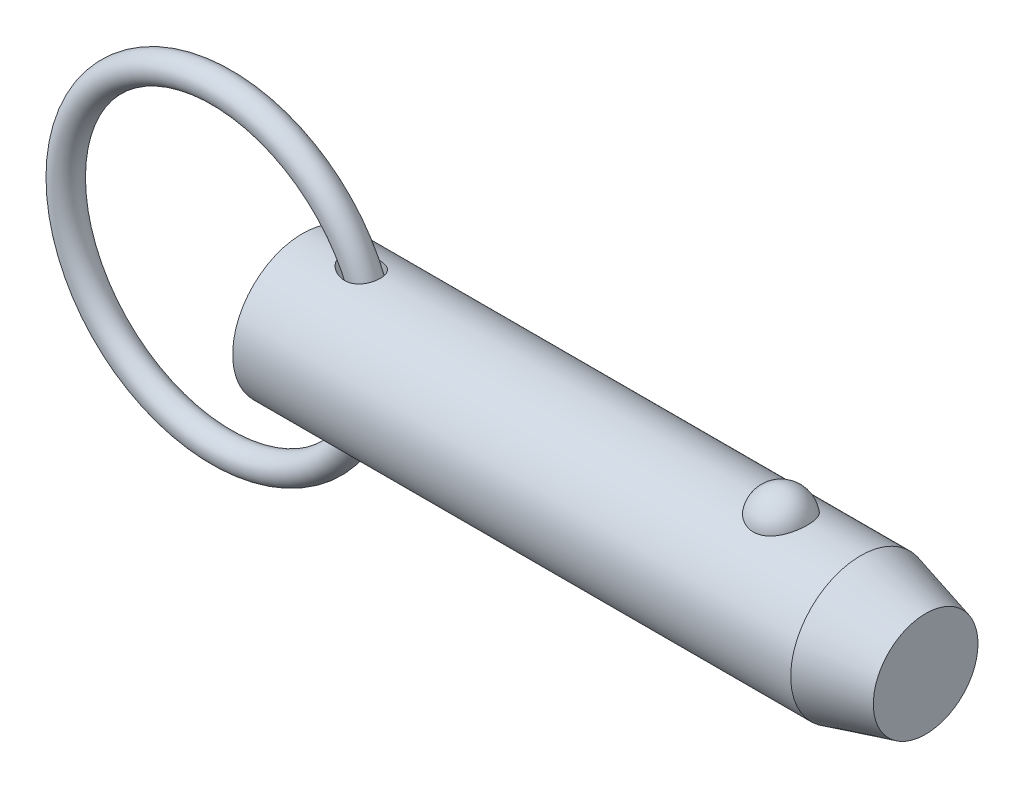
ISO-10303-21;
HEADER;
FILE_DESCRIPTION(('STEP AP214'),'2;1');
FILE_NAME('part.step','',(''),(''),'','','');
FILE_SCHEMA(('AUTOMOTIVE_DESIGN { 1 0 10303 214 1 1 1 1 }'));
ENDSEC;
DATA;
#1=APPLICATION_CONTEXT('core data for automotive mechanical design processes');
#2=APPLICATION_PROTOCOL_DEFINITION('international standard','automotive_design',2000,#1);
#3=PRODUCT_CONTEXT('',#1,'mechanical');
#4=PRODUCT('Part','Part','',(#3));
#5=PRODUCT_RELATED_PRODUCT_CATEGORY('part','',(#4));
#6=PRODUCT_DEFINITION_FORMATION('','',#4);
#7=PRODUCT_DEFINITION_CONTEXT('part definition',#1,'design');
#8=PRODUCT_DEFINITION('design','',#6,#7);
#9=PRODUCT_DEFINITION_SHAPE('','',#8);
#10=(LENGTH_UNIT() NAMED_UNIT(*) SI_UNIT(.MILLI.,.METRE.));
#11=(NAMED_UNIT(*) PLANE_ANGLE_UNIT() SI_UNIT($,.RADIAN.));
#12=(NAMED_UNIT(*) SI_UNIT($,.STERADIAN.) SOLID_ANGLE_UNIT());
#13=UNCERTAINTY_MEASURE_WITH_UNIT(LENGTH_MEASURE(1.E-05),#10,'distance_accuracy_value','');
#14=(GEOMETRIC_REPRESENTATION_CONTEXT(3) GLOBAL_UNCERTAINTY_ASSIGNED_CONTEXT((#13)) GLOBAL_UNIT_ASSIGNED_CONTEXT((#10,
#11,#12)) REPRESENTATION_CONTEXT('',''));
#15=CARTESIAN_POINT('',(0.,0.,0.));
#16=DIRECTION('',(0.,0.,1.));
#17=DIRECTION('',(1.,0.,0.));
#18=AXIS2_PLACEMENT_3D('',#15,#16,#17);
#19=CARTESIAN_POINT('',(-8.23730968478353,0.,0.));
#20=DIRECTION('',(0.,0.,1.));
#21=DIRECTION('',(1.,0.,0.));
#22=AXIS2_PLACEMENT_3D('',#19,#20,#21);
#23=TOROIDAL_SURFACE('',#22,15.875,1.422);
#24=CARTESIAN_POINT('',(9.05969031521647,0.,0.));
#25=VERTEX_POINT('',#24);
#26=VERTEX_LOOP('',#25);
#27=FACE_BOUND('',#26,.T.);
#28=ADVANCED_FACE('P0_F12',(#27),#23,.T.);
#29=CLOSED_SHELL('',(#28));
#30=MANIFOLD_SOLID_BREP('P0_B1',#29);
#31=CARTESIAN_POINT('',(0.,0.,0.));
#32=DIRECTION('',(1.,0.,0.));
#33=DIRECTION('',(0.,0.,-1.));
#34=AXIS2_PLACEMENT_3D('',#31,#32,#33);
#35=CYLINDRICAL_SURFACE('',#34,7.11);
#36=CARTESIAN_POINT('',(3.98467340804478,7.10072679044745,-0.363013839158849));
#37=CARTESIAN_POINT('',(4.00971652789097,7.09600153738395,-0.45539194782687));
#38=CARTESIAN_POINT('',(4.04401947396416,7.08958406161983,-0.545230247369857));
#39=CARTESIAN_POINT('',(4.12810160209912,7.07427055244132,-0.717157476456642));
#40=CARTESIAN_POINT('',(4.17791765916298,7.06536861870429,-0.799227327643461));
#41=CARTESIAN_POINT('',(4.28924471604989,7.04620300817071,-0.953469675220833));
#42=CARTESIAN_POINT('',(4.35063580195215,7.035953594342,-1.02573162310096));
#43=CARTESIAN_POINT('',(4.48282610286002,7.01493313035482,-1.16081412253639));
#44=CARTESIAN_POINT('',(4.55362244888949,7.00416223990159,-1.22363754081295));
#45=CARTESIAN_POINT('',(4.71659336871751,6.98090398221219,-1.35055080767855));
#46=CARTESIAN_POINT('',(4.81029272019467,6.96847103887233,-1.41269256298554));
#47=CARTESIAN_POINT('',(5.0057240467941,6.94515366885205,-1.52319699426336));
#48=CARTESIAN_POINT('',(5.10746392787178,6.93427079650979,-1.57154588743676));
#49=CARTESIAN_POINT('',(5.33503739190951,6.91346066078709,-1.66091325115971));
#50=CARTESIAN_POINT('',(5.46199550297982,6.90402388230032,-1.69921932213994));
#51=CARTESIAN_POINT('',(5.72084799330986,6.89024030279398,-1.75428261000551));
#52=CARTESIAN_POINT('',(5.85274301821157,6.88589416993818,-1.77103699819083));
#53=CARTESIAN_POINT('',(6.11557710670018,6.88337277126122,-1.78081990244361));
#54=CARTESIAN_POINT('',(6.24650031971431,6.88510489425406,-1.77420448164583));
#55=CARTESIAN_POINT('',(6.50446311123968,6.89478744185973,-1.73620392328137));
#56=CARTESIAN_POINT('',(6.6315075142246,6.90272978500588,-1.70485097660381));
#57=CARTESIAN_POINT('',(6.85933269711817,6.92243075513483,-1.62281888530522));
#58=CARTESIAN_POINT('',(6.96133251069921,6.93352131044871,-1.5753580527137));
#59=CARTESIAN_POINT('',(7.15436649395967,6.95824811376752,-1.46226310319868));
#60=CARTESIAN_POINT('',(7.24540699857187,6.97188287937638,-1.3966395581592));
#61=CARTESIAN_POINT('',(7.40446019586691,6.99838217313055,-1.25668991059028));
#62=CARTESIAN_POINT('',(7.473875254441,7.01118308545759,-1.18393777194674));
#63=CARTESIAN_POINT('',(7.59904891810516,7.03582803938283,-1.02736918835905));
#64=CARTESIAN_POINT('',(7.65481029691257,7.04767227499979,-0.943554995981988));
#65=CARTESIAN_POINT('',(7.74982438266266,7.06873077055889,-0.76979592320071));
#66=CARTESIAN_POINT('',(7.7894903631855,7.07800861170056,-0.680084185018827));
#67=CARTESIAN_POINT('',(7.85354088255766,7.09334756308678,-0.495102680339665));
#68=CARTESIAN_POINT('',(7.87792559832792,7.09940871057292,-0.399832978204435));
#69=CARTESIAN_POINT('',(7.9108898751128,7.10766731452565,-0.206294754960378));
#70=CARTESIAN_POINT('',(7.91944662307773,7.10985919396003,-0.108022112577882));
#71=CARTESIAN_POINT('',(7.920501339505,7.11012756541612,0.0886168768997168));
#72=CARTESIAN_POINT('',(7.91299895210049,7.10820396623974,0.186983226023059));
#73=CARTESIAN_POINT('',(7.88205794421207,7.10043733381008,0.381270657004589));
#74=CARTESIAN_POINT('',(7.85857985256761,7.09458459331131,0.477185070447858));
#75=CARTESIAN_POINT('',(7.79617406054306,7.07958431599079,0.663575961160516));
#76=CARTESIAN_POINT('',(7.75724672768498,7.07043685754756,0.754052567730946));
#77=CARTESIAN_POINT('',(7.66496731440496,7.04987259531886,0.926798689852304));
#78=CARTESIAN_POINT('',(7.61164530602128,7.0384605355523,1.00908483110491));
#79=CARTESIAN_POINT('',(7.49191707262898,7.01461776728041,1.16333092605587));
#80=CARTESIAN_POINT('',(7.42551210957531,7.00218715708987,1.235291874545));
#81=CARTESIAN_POINT('',(7.28164031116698,6.97770944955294,1.36680167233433));
#82=CARTESIAN_POINT('',(7.20420170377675,6.96566146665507,1.42638126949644));
#83=CARTESIAN_POINT('',(7.0403906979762,6.94319963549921,1.53199377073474));
#84=CARTESIAN_POINT('',(6.95401827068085,6.93278579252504,1.57802663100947));
#85=CARTESIAN_POINT('',(6.7731858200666,6.91444459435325,1.65656940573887));
#86=CARTESIAN_POINT('',(6.67860569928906,6.90656682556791,1.68881327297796));
#87=CARTESIAN_POINT('',(6.48544119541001,6.89422806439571,1.73849768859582));
#88=CARTESIAN_POINT('',(6.38685561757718,6.88976809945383,1.755933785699));
#89=CARTESIAN_POINT('',(6.18089829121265,6.88429907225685,1.77726234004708));
#90=CARTESIAN_POINT('',(6.07340937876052,6.88356485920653,1.78007646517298));
#91=CARTESIAN_POINT('',(5.85921220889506,6.886086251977,1.77029087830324));
#92=CARTESIAN_POINT('',(5.75250426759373,6.88934339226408,1.75768523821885));
#93=CARTESIAN_POINT('',(5.52848027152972,6.89994454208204,1.71563399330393));
#94=CARTESIAN_POINT('',(5.41155168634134,6.90775772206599,1.68424184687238));
#95=CARTESIAN_POINT('',(5.18376466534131,6.92670168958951,1.60454711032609));
#96=CARTESIAN_POINT('',(5.07291446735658,6.9378368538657,1.5562221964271));
#97=CARTESIAN_POINT('',(4.84835244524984,6.96347168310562,1.43744827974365));
#98=CARTESIAN_POINT('',(4.73562531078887,6.97820486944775,1.36517310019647));
#99=CARTESIAN_POINT('',(4.52504912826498,7.00822340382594,1.20158053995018));
#100=CARTESIAN_POINT('',(4.42717478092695,7.02350775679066,1.11029618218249));
#101=CARTESIAN_POINT('',(4.27935716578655,7.04784659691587,0.940654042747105));
#102=CARTESIAN_POINT('',(4.2239722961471,7.05736064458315,0.867099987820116));
#103=CARTESIAN_POINT('',(4.12558347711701,7.07469854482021,0.711919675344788));
#104=CARTESIAN_POINT('',(4.08256922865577,7.0825238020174,0.630300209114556));
#105=CARTESIAN_POINT('',(4.01142860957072,7.09565978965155,0.459428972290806));
#106=CARTESIAN_POINT('',(3.98346043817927,7.10094374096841,0.370107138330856));
#107=CARTESIAN_POINT('',(3.95517285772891,7.1063173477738,0.233358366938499));
#108=CARTESIAN_POINT('',(3.94802115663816,7.1076831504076,0.187321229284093));
#109=CARTESIAN_POINT('',(3.93842121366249,7.10951900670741,0.0947476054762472));
#110=CARTESIAN_POINT('',(3.93597129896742,7.10998937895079,0.0482113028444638));
#111=CARTESIAN_POINT('',(3.93584361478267,7.11001358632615,-0.0598597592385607));
#112=CARTESIAN_POINT('',(3.9399538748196,7.10922402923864,-0.121405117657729));
#113=CARTESIAN_POINT('',(3.95632793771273,7.10609781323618,-0.243320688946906));
#114=CARTESIAN_POINT('',(3.96859135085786,7.10376122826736,-0.303690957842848));
#115=CARTESIAN_POINT('',(3.98467340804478,7.10072679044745,-0.363013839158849));
#116=B_SPLINE_CURVE_WITH_KNOTS('',3,(#36,#37,#38,#39,#40,#41,#42,#43,#44,#45,#46,#47,#48,#49,
#50,#51,#52,#53,#54,#55,#56,#57,#58,#59,#60,#61,#62,#63,#64,#65,#66,#67,#68,#69,#70,#71,#72,#73,
#74,#75,#76,#77,#78,#79,#80,#81,#82,#83,#84,#85,#86,#87,#88,#89,#90,#91,#92,#93,#94,#95,#96,#97,
#98,#99,#100,#101,#102,#103,#104,#105,#106,#107,#108,#109,#110,#111,#112,#113,#114,#115),
.UNSPECIFIED.,.T.,.F.,(4,2,2,2,2,2,2,2,2,2,2,2,2,2,2,2,2,2,2,2,2,2,2,2,2,2,2,2,2,2,2,2,2,2,2,2,
2,2,2,4),(0.,0.287206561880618,0.575101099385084,0.860162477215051,1.14513709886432,
1.48324846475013,1.82169652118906,2.21865672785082,2.6156690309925,3.00665870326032,
3.39714041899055,3.73437585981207,4.07141541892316,4.37402271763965,4.67656849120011,
4.97076150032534,5.26495110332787,5.55956439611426,5.85418421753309,6.14953461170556,
6.44487798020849,6.73960905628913,7.03431171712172,7.32827352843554,7.6222362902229,
7.9216396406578,8.22113296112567,8.54242840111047,8.86384740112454,9.22635035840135,
9.58933304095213,9.99153142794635,10.3930368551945,10.6697219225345,10.9461759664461,
11.2254825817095,11.3650959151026,11.5046595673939,11.6891051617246,11.8735419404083),.UNSPECIFIED.);
#117=CARTESIAN_POINT('',(3.98467340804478,7.10072679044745,-0.363013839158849));
#118=VERTEX_POINT('',#117);
#119=EDGE_CURVE('P1_E40',#118,#118,#116,.T.);
#120=ORIENTED_EDGE('',*,*,#119,.T.);
#121=EDGE_LOOP('',(#120));
#122=FACE_BOUND('',#121,.T.);
#123=CARTESIAN_POINT('',(56.8362796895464,0.,0.));
#124=DIRECTION('',(1.,0.,0.));
#125=DIRECTION('',(0.,0.,-1.));
#126=AXIS2_PLACEMENT_3D('',#123,#124,#125);
#127=CIRCLE('',#126,7.11);
#128=CARTESIAN_POINT('',(56.8362796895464,0.,-7.11));
#129=VERTEX_POINT('',#128);
#130=EDGE_CURVE('P1_E25',#129,#129,#127,.T.);
#131=ORIENTED_EDGE('',*,*,#130,.F.);
#132=EDGE_LOOP('',(#131));
#133=FACE_BOUND('',#132,.T.);
#134=CARTESIAN_POINT('',(0.,0.,0.));
#135=DIRECTION('',(1.,0.,0.));
#136=DIRECTION('',(0.,0.,-1.));
#137=AXIS2_PLACEMENT_3D('',#134,#135,#136);
#138=CIRCLE('',#137,7.11);
#139=CARTESIAN_POINT('',(0.,0.,-7.11));
#140=VERTEX_POINT('',#139);
#141=EDGE_CURVE('P1_E9',#140,#140,#138,.T.);
#142=ORIENTED_EDGE('',*,*,#141,.T.);
#143=EDGE_LOOP('',(#142));
#144=FACE_BOUND('',#143,.T.);
#145=CARTESIAN_POINT('',(48.729258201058,6.53646663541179,2.79762469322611));
#146=CARTESIAN_POINT('',(48.5844296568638,6.53647876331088,2.79761243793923));
#147=CARTESIAN_POINT('',(48.439368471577,6.54144531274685,2.78608115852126));
#148=CARTESIAN_POINT('',(48.1532920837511,6.56077791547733,2.74023282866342));
#149=CARTESIAN_POINT('',(48.0122884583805,6.57516852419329,2.70585624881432));
#150=CARTESIAN_POINT('',(47.7388833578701,6.61165072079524,2.61544042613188));
#151=CARTESIAN_POINT('',(47.6064602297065,6.63372195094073,2.55945840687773));
#152=CARTESIAN_POINT('',(47.3532337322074,6.68316012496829,2.42742958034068));
#153=CARTESIAN_POINT('',(47.2324254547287,6.71052481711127,2.35139129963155));
#154=CARTESIAN_POINT('',(47.0016372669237,6.76860821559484,2.17866150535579));
#155=CARTESIAN_POINT('',(46.8920857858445,6.79940242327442,2.08142342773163));
#156=CARTESIAN_POINT('',(46.6903340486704,6.86050242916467,1.87020907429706));
#157=CARTESIAN_POINT('',(46.5981390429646,6.89080807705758,1.75622775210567));
#158=CARTESIAN_POINT('',(46.4292547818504,6.94923069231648,1.50900646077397));
#159=CARTESIAN_POINT('',(46.3534289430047,6.97719213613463,1.37513873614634));
#160=CARTESIAN_POINT('',(46.2242063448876,7.02647251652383,1.09584817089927));
#161=CARTESIAN_POINT('',(46.1708109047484,7.04779106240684,0.950424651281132));
#162=CARTESIAN_POINT('',(46.0871019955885,7.08180248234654,0.650508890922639));
#163=CARTESIAN_POINT('',(46.0570253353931,7.09440672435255,0.495940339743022));
#164=CARTESIAN_POINT('',(46.021473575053,7.10935121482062,0.183515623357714));
#165=CARTESIAN_POINT('',(46.0159974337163,7.11169189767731,0.0256595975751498));
#166=CARTESIAN_POINT('',(46.029700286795,7.10589702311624,-0.287512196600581));
#167=CARTESIAN_POINT('',(46.0486823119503,7.0978451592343,-0.442838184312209));
#168=CARTESIAN_POINT('',(46.1105745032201,7.07221860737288,-0.747830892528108));
#169=CARTESIAN_POINT('',(46.1534850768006,7.05464375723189,-0.897497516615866));
#170=CARTESIAN_POINT('',(46.2624527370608,7.01171031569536,-1.1872286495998));
#171=CARTESIAN_POINT('',(46.3285458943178,6.98633960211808,-1.32727778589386));
#172=CARTESIAN_POINT('',(46.4825362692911,6.93042258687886,-1.59370324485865));
#173=CARTESIAN_POINT('',(46.5704355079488,6.89987580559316,-1.72007829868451));
#174=CARTESIAN_POINT('',(46.7669269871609,6.83659510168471,-1.95657345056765));
#175=CARTESIAN_POINT('',(46.8756640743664,6.80384697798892,-2.06656957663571));
#176=CARTESIAN_POINT('',(47.1109686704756,6.7400183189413,-2.26611005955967));
#177=CARTESIAN_POINT('',(47.2375350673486,6.70893767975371,-2.35565569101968));
#178=CARTESIAN_POINT('',(47.5028454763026,6.65264442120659,-2.51019726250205));
#179=CARTESIAN_POINT('',(47.6413230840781,6.62733449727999,-2.5756139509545));
#180=CARTESIAN_POINT('',(47.9285194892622,6.58495995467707,-2.6821113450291));
#181=CARTESIAN_POINT('',(48.0772343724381,6.56789220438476,-2.72320129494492));
#182=CARTESIAN_POINT('',(48.3726268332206,6.54478663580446,-2.77825810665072));
#183=CARTESIAN_POINT('',(48.5190295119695,6.53823639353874,-2.7934872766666));
#184=CARTESIAN_POINT('',(48.8124700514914,6.53532718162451,-2.80028921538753));
#185=CARTESIAN_POINT('',(48.9595077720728,6.53896606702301,-2.79186696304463));
#186=CARTESIAN_POINT('',(49.2449210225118,6.55570357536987,-2.75232178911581));
#187=CARTESIAN_POINT('',(49.3834221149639,6.56848455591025,-2.7219607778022));
#188=CARTESIAN_POINT('',(49.6531142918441,6.60173528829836,-2.64028774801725));
#189=CARTESIAN_POINT('',(49.784304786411,6.62220565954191,-2.5889740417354));
#190=CARTESIAN_POINT('',(50.0388462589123,6.6691792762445,-2.46547820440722));
#191=CARTESIAN_POINT('',(50.1619691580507,6.69580233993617,-2.392872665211));
#192=CARTESIAN_POINT('',(50.3944418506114,6.75207041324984,-2.22915269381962));
#193=CARTESIAN_POINT('',(50.5037884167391,6.78171612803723,-2.1380339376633));
#194=CARTESIAN_POINT('',(50.711642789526,6.84264629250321,-1.93445592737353));
#195=CARTESIAN_POINT('',(50.8093178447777,6.87393748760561,-1.82114774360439));
#196=CARTESIAN_POINT('',(50.9850112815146,6.93345710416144,-1.57947787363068));
#197=CARTESIAN_POINT('',(51.0630261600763,6.96168497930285,-1.45111351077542));
#198=CARTESIAN_POINT('',(51.1999857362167,7.01307558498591,-1.17842708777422));
#199=CARTESIAN_POINT('',(51.2582588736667,7.03605262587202,-1.03373189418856));
#200=CARTESIAN_POINT('',(51.3510815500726,7.07340932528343,-0.735867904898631));
#201=CARTESIAN_POINT('',(51.3856311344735,7.08778900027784,-0.582699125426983));
#202=CARTESIAN_POINT('',(51.430274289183,7.10647639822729,-0.272420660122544));
#203=CARTESIAN_POINT('',(51.44039710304,7.11079616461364,-0.115315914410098));
#204=CARTESIAN_POINT('',(51.436061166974,7.10896059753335,0.198488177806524));
#205=CARTESIAN_POINT('',(51.4216031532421,7.10280557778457,0.355187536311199));
#206=CARTESIAN_POINT('',(51.3685727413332,7.08071500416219,0.66272439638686));
#207=CARTESIAN_POINT('',(51.3301505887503,7.06484039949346,0.813592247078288));
#208=CARTESIAN_POINT('',(51.230101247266,7.0249589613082,1.10629159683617));
#209=CARTESIAN_POINT('',(51.1684724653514,7.00095156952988,1.24812247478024));
#210=CARTESIAN_POINT('',(51.0227668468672,6.94706632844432,1.51976439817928));
#211=CARTESIAN_POINT('',(50.9385448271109,6.91715085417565,1.6494901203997));
#212=CARTESIAN_POINT('',(50.7495861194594,6.85470565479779,1.89231285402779));
#213=CARTESIAN_POINT('',(50.6448501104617,6.82217601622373,2.0054104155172));
#214=CARTESIAN_POINT('',(50.4171030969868,6.75805358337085,2.21190674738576));
#215=CARTESIAN_POINT('',(50.294082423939,6.72646129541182,2.30529503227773));
#216=CARTESIAN_POINT('',(50.0327347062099,6.66789520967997,2.4695990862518));
#217=CARTESIAN_POINT('',(49.8944019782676,6.64092313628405,2.5405064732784));
#218=CARTESIAN_POINT('',(49.6111828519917,6.5957258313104,2.65560045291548));
#219=CARTESIAN_POINT('',(49.4666660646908,6.57724013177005,2.70059539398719));
#220=CARTESIAN_POINT('',(49.1715469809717,6.55006426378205,2.76587321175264));
#221=CARTESIAN_POINT('',(49.0209640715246,6.54134511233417,2.78622922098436));
#222=CARTESIAN_POINT('',(48.8230463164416,6.53697847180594,2.79642434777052));
#223=CARTESIAN_POINT('',(48.7761644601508,6.53646270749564,2.79762866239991));
#224=CARTESIAN_POINT('',(48.729258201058,6.53646663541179,2.79762469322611));
#225=B_SPLINE_CURVE_WITH_KNOTS('',3,(#145,#146,#147,#148,#149,#150,#151,#152,#153,#154,#155,
#156,#157,#158,#159,#160,#161,#162,#163,#164,#165,#166,#167,#168,#169,#170,#171,#172,#173,#174,
#175,#176,#177,#178,#179,#180,#181,#182,#183,#184,#185,#186,#187,#188,#189,#190,#191,#192,#193,
#194,#195,#196,#197,#198,#199,#200,#201,#202,#203,#204,#205,#206,#207,#208,#209,#210,#211,#212,
#213,#214,#215,#216,#217,#218,#219,#220,#221,#222,#223,#224),.UNSPECIFIED.,.T.,.F.,(4,2,2,2,2,2,
2,2,2,2,2,2,2,2,2,2,2,2,2,2,2,2,2,2,2,2,2,2,2,2,2,2,2,2,2,2,2,2,2,4),(0.,0.434355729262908,
0.86984774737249,1.30419416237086,1.73835621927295,2.18541922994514,2.63261726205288,
3.09954261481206,3.56649542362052,4.03813031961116,4.50974525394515,4.97758575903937,
5.44543423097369,5.91401389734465,6.38263700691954,6.85464418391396,7.32662193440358,
7.78992971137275,8.2530613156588,8.69285754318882,9.13256119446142,9.55768625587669,
9.98284556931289,10.4171106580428,10.851477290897,11.3079089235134,11.7644218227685,
12.2351898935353,12.7059570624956,13.1761603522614,13.6463495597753,14.1136200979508,
14.5809227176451,15.0513032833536,15.5216682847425,15.9922828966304,16.4630727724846,
16.918245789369,17.3720644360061,17.5127411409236),.UNSPECIFIED.);
#226=CARTESIAN_POINT('',(48.729258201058,6.53646663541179,2.79762469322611));
#227=VERTEX_POINT('',#226);
#228=EDGE_CURVE('P1_E34',#227,#227,#225,.T.);
#229=ORIENTED_EDGE('',*,*,#228,.T.);
#230=EDGE_LOOP('',(#229));
#231=FACE_BOUND('',#230,.T.);
#232=CARTESIAN_POINT('',(3.98467340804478,-7.10072679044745,-0.363013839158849));
#233=CARTESIAN_POINT('',(3.96426456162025,-7.10457733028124,-0.287714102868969));
#234=CARTESIAN_POINT('',(3.95000501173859,-7.10730349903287,-0.210695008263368));
#235=CARTESIAN_POINT('',(3.93481801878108,-7.11020840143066,-0.0553038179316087));
#236=CARTESIAN_POINT('',(3.93388435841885,-7.11038832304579,0.0230676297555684));
#237=CARTESIAN_POINT('',(3.94541910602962,-7.10817995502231,0.178714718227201));
#238=CARTESIAN_POINT('',(3.95787987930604,-7.10579312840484,0.25599095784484));
#239=CARTESIAN_POINT('',(3.99523775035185,-7.09872642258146,0.407352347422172));
#240=CARTESIAN_POINT('',(4.02014065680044,-7.09404547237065,0.481435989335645));
#241=CARTESIAN_POINT('',(4.08119600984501,-7.08278363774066,0.625775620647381));
#242=CARTESIAN_POINT('',(4.11749458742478,-7.07617815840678,0.695967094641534));
#243=CARTESIAN_POINT('',(4.19940836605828,-7.06165305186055,0.830508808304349));
#244=CARTESIAN_POINT('',(4.24502952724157,-7.0537325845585,0.894855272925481));
#245=CARTESIAN_POINT('',(4.36790232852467,-7.03310314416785,1.04688574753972));
#246=CARTESIAN_POINT('',(4.44977459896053,-7.01993229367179,1.13078695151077));
#247=CARTESIAN_POINT('',(4.62610796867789,-6.99351259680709,1.28411726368));
#248=CARTESIAN_POINT('',(4.7205898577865,-6.98026365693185,1.35352197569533));
#249=CARTESIAN_POINT('',(4.92036507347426,-6.9549104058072,1.47831921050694));
#250=CARTESIAN_POINT('',(5.02579054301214,-6.94282458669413,1.53350332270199));
#251=CARTESIAN_POINT('',(5.24378330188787,-6.92129098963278,1.62793610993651));
#252=CARTESIAN_POINT('',(5.35635066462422,-6.91184323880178,1.66718462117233));
#253=CARTESIAN_POINT('',(5.60134354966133,-6.89573491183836,1.73269893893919));
#254=CARTESIAN_POINT('',(5.73444697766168,-6.8895970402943,1.75661057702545));
#255=CARTESIAN_POINT('',(6.00300738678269,-6.88344616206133,1.78057487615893));
#256=CARTESIAN_POINT('',(6.13846360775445,-6.88343121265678,1.78063510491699));
#257=CARTESIAN_POINT('',(6.39660470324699,-6.88981379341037,1.75576480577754));
#258=CARTESIAN_POINT('',(6.51947843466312,-6.89572457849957,1.73273121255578));
#259=CARTESIAN_POINT('',(6.75813770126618,-6.91274434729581,1.66352936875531));
#260=CARTESIAN_POINT('',(6.87393155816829,-6.92384709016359,1.61738888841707));
#261=CARTESIAN_POINT('',(7.07801861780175,-6.94787316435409,1.51052664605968));
#262=CARTESIAN_POINT('',(7.16789841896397,-6.96033024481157,1.45271574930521));
#263=CARTESIAN_POINT('',(7.33546773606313,-6.98638661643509,1.32171912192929));
#264=CARTESIAN_POINT('',(7.41316182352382,-6.99998547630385,1.24853918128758));
#265=CARTESIAN_POINT('',(7.54861420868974,-7.02559503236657,1.09486170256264));
#266=CARTESIAN_POINT('',(7.60741145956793,-7.03764930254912,1.01528346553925));
#267=CARTESIAN_POINT('',(7.71070740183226,-7.0598657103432,0.847099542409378));
#268=CARTESIAN_POINT('',(7.75520788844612,-7.0700280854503,0.758494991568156));
#269=CARTESIAN_POINT('',(7.82836147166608,-7.08722075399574,0.575936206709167));
#270=CARTESIAN_POINT('',(7.85719783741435,-7.09428707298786,0.482058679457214));
#271=CARTESIAN_POINT('',(7.89918378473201,-7.10470260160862,0.29065874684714));
#272=CARTESIAN_POINT('',(7.91233308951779,-7.10805174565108,0.193136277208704));
#273=CARTESIAN_POINT('',(7.92267451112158,-7.11067890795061,-0.00313968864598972));
#274=CARTESIAN_POINT('',(7.91981203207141,-7.10994299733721,-0.10189624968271));
#275=CARTESIAN_POINT('',(7.89806489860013,-7.10444651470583,-0.297516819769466));
#276=CARTESIAN_POINT('',(7.87918005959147,-7.09968589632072,-0.394380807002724));
#277=CARTESIAN_POINT('',(7.82577988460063,-7.0866471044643,-0.58355375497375));
#278=CARTESIAN_POINT('',(7.79124976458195,-7.07836560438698,-0.675858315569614));
#279=CARTESIAN_POINT('',(7.70736343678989,-7.05919003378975,-0.853167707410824));
#280=CARTESIAN_POINT('',(7.65800801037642,-7.04829610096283,-0.938172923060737));
#281=CARTESIAN_POINT('',(7.54590141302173,-7.02513961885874,-1.09819812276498));
#282=CARTESIAN_POINT('',(7.48319521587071,-7.01288172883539,-1.17325029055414));
#283=CARTESIAN_POINT('',(7.34599775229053,-6.98832192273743,-1.31164333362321));
#284=CARTESIAN_POINT('',(7.27150757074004,-6.97602001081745,-1.37498528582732));
#285=CARTESIAN_POINT('',(7.11277776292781,-6.95268608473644,-1.48849974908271));
#286=CARTESIAN_POINT('',(7.02852525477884,-6.94165578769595,-1.53865456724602));
#287=CARTESIAN_POINT('',(6.85282430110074,-6.92200320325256,-1.62478650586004));
#288=CARTESIAN_POINT('',(6.76137511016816,-6.91338116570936,-1.66076215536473));
#289=CARTESIAN_POINT('',(6.57061179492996,-6.89906044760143,-1.71930563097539));
#290=CARTESIAN_POINT('',(6.47113516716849,-6.89347290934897,-1.74136795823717));
#291=CARTESIAN_POINT('',(6.26989833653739,-6.88605020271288,-1.7704895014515));
#292=CARTESIAN_POINT('',(6.16813737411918,-6.88421630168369,-1.77754365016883));
#293=CARTESIAN_POINT('',(5.95492537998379,-6.88424071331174,-1.77745174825));
#294=CARTESIAN_POINT('',(5.8434768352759,-6.88646827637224,-1.76888555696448));
#295=CARTESIAN_POINT('',(5.62307560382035,-6.89483827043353,-1.73596677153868));
#296=CARTESIAN_POINT('',(5.51412477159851,-6.90098351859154,-1.71160281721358));
#297=CARTESIAN_POINT('',(5.28644478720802,-6.91743803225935,-1.64393691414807));
#298=CARTESIAN_POINT('',(5.16837217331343,-6.92819628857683,-1.59852806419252));
#299=CARTESIAN_POINT('',(4.94091825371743,-6.95234836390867,-1.4899796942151));
#300=CARTESIAN_POINT('',(4.83153887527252,-6.96574276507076,-1.42683625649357));
#301=CARTESIAN_POINT('',(4.63576710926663,-6.99209234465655,-1.29112257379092));
#302=CARTESIAN_POINT('',(4.54816728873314,-7.00494184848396,-1.22027748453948));
#303=CARTESIAN_POINT('',(4.38554897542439,-7.03019055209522,-1.0652111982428));
#304=CARTESIAN_POINT('',(4.31052141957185,-7.04259007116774,-0.980999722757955));
#305=CARTESIAN_POINT('',(4.18551811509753,-7.0640229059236,-0.811206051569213));
#306=CARTESIAN_POINT('',(4.13358417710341,-7.07328321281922,-0.727107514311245));
#307=CARTESIAN_POINT('',(4.04607461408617,-7.0891994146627,-0.550580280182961));
#308=CARTESIAN_POINT('',(4.01046401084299,-7.09586087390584,-0.458169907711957));
#309=CARTESIAN_POINT('',(3.98467340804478,-7.10072679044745,-0.363013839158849));
#310=B_SPLINE_CURVE_WITH_KNOTS('',3,(#232,#233,#234,#235,#236,#237,#238,#239,#240,#241,#242,
#243,#244,#245,#246,#247,#248,#249,#250,#251,#252,#253,#254,#255,#256,#257,#258,#259,#260,#261,
#262,#263,#264,#265,#266,#267,#268,#269,#270,#271,#272,#273,#274,#275,#276,#277,#278,#279,#280,
#281,#282,#283,#284,#285,#286,#287,#288,#289,#290,#291,#292,#293,#294,#295,#296,#297,#298,#299,
#300,#301,#302,#303,#304,#305,#306,#307,#308,#309),.UNSPECIFIED.,.T.,.F.,(4,2,2,2,2,2,2,2,2,2,2,
2,2,2,2,2,2,2,2,2,2,2,2,2,2,2,2,2,2,2,2,2,2,2,2,2,2,2,4),(0.,0.23402065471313,0.467932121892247,
0.701710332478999,0.935597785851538,1.17261620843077,1.40978663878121,1.76177576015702,
2.11435255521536,2.47183528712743,2.8293216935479,3.23332937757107,3.63720887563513,
4.01042610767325,4.38319587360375,4.70425151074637,5.02518641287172,5.32277979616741,
5.62033579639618,5.91433101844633,6.2083314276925,6.50333490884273,6.79834178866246,
7.09362801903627,7.38889868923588,7.6831900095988,7.9774542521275,8.27211131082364,
8.56679892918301,8.8716552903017,9.17661456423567,9.51069129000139,9.84500851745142,
10.2243046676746,10.6036846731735,10.9425776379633,11.2812252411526,11.5775945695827,
11.8733258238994),.UNSPECIFIED.);
#311=CARTESIAN_POINT('',(3.98467340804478,-7.10072679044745,-0.363013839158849));
#312=VERTEX_POINT('',#311);
#313=EDGE_CURVE('P1_E17',#312,#312,#310,.T.);
#314=ORIENTED_EDGE('',*,*,#313,.T.);
#315=EDGE_LOOP('',(#314));
#316=FACE_BOUND('',#315,.T.);
#317=ADVANCED_FACE('P1_F13',(#122,#133,#144,#231,#316),#35,.T.);
#318=CARTESIAN_POINT('',(0.,0.,0.));
#319=DIRECTION('',(-1.,0.,0.));
#320=DIRECTION('',(0.,0.,1.));
#321=AXIS2_PLACEMENT_3D('',#318,#319,#320);
#322=PLANE('',#321);
#323=ORIENTED_EDGE('',*,*,#141,.F.);
#324=EDGE_LOOP('',(#323));
#325=FACE_BOUND('',#324,.T.);
#326=ADVANCED_FACE('P1_F15',(#325),#322,.T.);
#327=CARTESIAN_POINT('',(63.47,0.,0.));
#328=DIRECTION('',(-1.,0.,0.));
#329=DIRECTION('',(0.,0.,1.));
#330=AXIS2_PLACEMENT_3D('',#327,#328,#329);
#331=CONICAL_SURFACE('',#330,5.33250000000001,0.26179938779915);
#332=ORIENTED_EDGE('',*,*,#130,.T.);
#333=EDGE_LOOP('',(#332));
#334=FACE_BOUND('',#333,.T.);
#335=CARTESIAN_POINT('',(63.47,0.,0.));
#336=DIRECTION('',(1.,0.,0.));
#337=DIRECTION('',(0.,0.,-1.));
#338=AXIS2_PLACEMENT_3D('',#335,#336,#337);
#339=CIRCLE('',#338,5.33250000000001);
#340=CARTESIAN_POINT('',(63.47,0.,-5.33250000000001));
#341=VERTEX_POINT('',#340);
#342=EDGE_CURVE('P1_E30',#341,#341,#339,.T.);
#343=ORIENTED_EDGE('',*,*,#342,.F.);
#344=EDGE_LOOP('',(#343));
#345=FACE_BOUND('',#344,.T.);
#346=ADVANCED_FACE('P1_F55',(#334,#345),#331,.T.);
#347=CARTESIAN_POINT('',(63.47,5.33250000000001,0.));
#348=DIRECTION('',(1.,0.,0.));
#349=DIRECTION('',(0.,0.,-1.));
#350=AXIS2_PLACEMENT_3D('',#347,#348,#349);
#351=PLANE('',#350);
#352=ORIENTED_EDGE('',*,*,#342,.T.);
#353=EDGE_LOOP('',(#352));
#354=FACE_BOUND('',#353,.T.);
#355=ADVANCED_FACE('P1_F51',(#354),#351,.T.);
#356=CARTESIAN_POINT('',(48.729258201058,6.399,0.));
#357=DIRECTION('',(-1.,0.,0.));
#358=DIRECTION('',(0.,-1.,0.));
#359=AXIS2_PLACEMENT_3D('',#356,#357,#358);
#360=SPHERICAL_SURFACE('',#359,2.80099999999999);
#361=ORIENTED_EDGE('',*,*,#228,.F.);
#362=EDGE_LOOP('',(#361));
#363=FACE_BOUND('',#362,.T.);
#364=ADVANCED_FACE('P1_F46',(#363),#360,.T.);
#365=CARTESIAN_POINT('',(-8.23730968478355,0.,0.));
#366=DIRECTION('',(0.,0.,1.));
#367=DIRECTION('',(1.,0.,0.));
#368=AXIS2_PLACEMENT_3D('',#365,#366,#367);
#369=TOROIDAL_SURFACE('',#368,15.875,1.7775);
#370=ORIENTED_EDGE('',*,*,#313,.F.);
#371=EDGE_LOOP('',(#370));
#372=FACE_BOUND('',#371,.T.);
#373=ORIENTED_EDGE('',*,*,#119,.F.);
#374=EDGE_LOOP('',(#373));
#375=FACE_BOUND('',#374,.T.);
#376=ADVANCED_FACE('P1_F50',(#372,#375),#369,.F.);
#377=CLOSED_SHELL('',(#317,#326,#346,#355,#364,#376));
#378=MANIFOLD_SOLID_BREP('P1_B1',#377);
#379=ADVANCED_BREP_SHAPE_REPRESENTATION('',(#18,#30,#378),#14);
#380=SHAPE_DEFINITION_REPRESENTATION(#9,#379);
ENDSEC;
END-ISO-10303-21;
